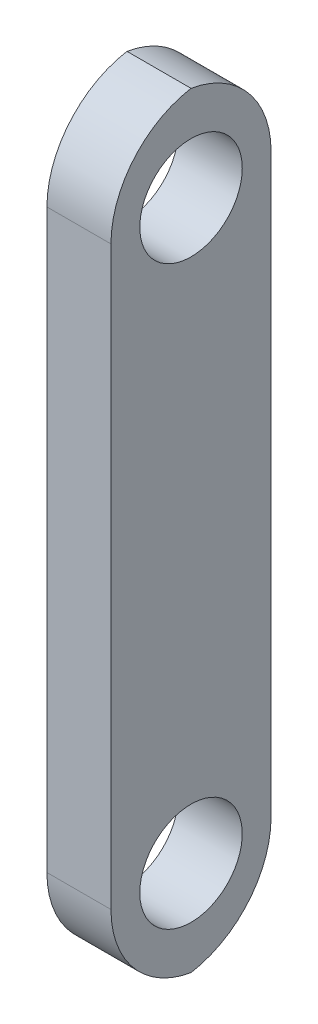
ISO-10303-21;
HEADER;
FILE_DESCRIPTION(('STEP AP214'),'2;1');
FILE_NAME('part.step','',(''),(''),'','','');
FILE_SCHEMA(('AUTOMOTIVE_DESIGN { 1 0 10303 214 1 1 1 1 }'));
ENDSEC;
DATA;
#1=APPLICATION_CONTEXT('core data for automotive mechanical design processes');
#2=APPLICATION_PROTOCOL_DEFINITION('international standard','automotive_design',2000,#1);
#3=PRODUCT_CONTEXT('',#1,'mechanical');
#4=PRODUCT('Part','Part','',(#3));
#5=PRODUCT_RELATED_PRODUCT_CATEGORY('part','',(#4));
#6=PRODUCT_DEFINITION_FORMATION('','',#4);
#7=PRODUCT_DEFINITION_CONTEXT('part definition',#1,'design');
#8=PRODUCT_DEFINITION('design','',#6,#7);
#9=PRODUCT_DEFINITION_SHAPE('','',#8);
#10=(LENGTH_UNIT() NAMED_UNIT(*) SI_UNIT(.MILLI.,.METRE.));
#11=(NAMED_UNIT(*) PLANE_ANGLE_UNIT() SI_UNIT($,.RADIAN.));
#12=(NAMED_UNIT(*) SI_UNIT($,.STERADIAN.) SOLID_ANGLE_UNIT());
#13=UNCERTAINTY_MEASURE_WITH_UNIT(LENGTH_MEASURE(1.E-05),#10,'distance_accuracy_value','');
#14=(GEOMETRIC_REPRESENTATION_CONTEXT(3) GLOBAL_UNCERTAINTY_ASSIGNED_CONTEXT((#13)) GLOBAL_UNIT_ASSIGNED_CONTEXT((#10,
#11,#12)) REPRESENTATION_CONTEXT('',''));
#15=CARTESIAN_POINT('',(0.,0.,0.));
#16=DIRECTION('',(0.,0.,1.));
#17=DIRECTION('',(1.,0.,0.));
#18=AXIS2_PLACEMENT_3D('',#15,#16,#17);
#19=CARTESIAN_POINT('',(2.,0.,-7.10219321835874));
#20=DIRECTION('',(0.,0.,1.));
#21=DIRECTION('',(0.,-1.,0.));
#22=AXIS2_PLACEMENT_3D('',#19,#20,#21);
#23=PLANE('',#22);
#24=DIRECTION('',(0.,1.,0.));
#25=VECTOR('',#24,1.);
#26=CARTESIAN_POINT('',(2.,0.,-7.10219321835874));
#27=LINE('',#26,#25);
#28=CARTESIAN_POINT('',(2.,-21.,-7.10219321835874));
#29=VERTEX_POINT('',#28);
#30=CARTESIAN_POINT('',(2.,-3.,-7.10219321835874));
#31=VERTEX_POINT('',#30);
#32=EDGE_CURVE('E120',#29,#31,#27,.T.);
#33=ORIENTED_EDGE('',*,*,#32,.F.);
#34=DIRECTION('',(-1.,0.,0.));
#35=VECTOR('',#34,1.);
#36=CARTESIAN_POINT('',(2.,-21.,-7.10219321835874));
#37=LINE('',#36,#35);
#38=CARTESIAN_POINT('',(0.,-21.,-7.10219321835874));
#39=VERTEX_POINT('',#38);
#40=EDGE_CURVE('E107',#29,#39,#37,.T.);
#41=ORIENTED_EDGE('',*,*,#40,.T.);
#42=DIRECTION('',(0.,1.,0.));
#43=VECTOR('',#42,1.);
#44=CARTESIAN_POINT('',(0.,0.,-7.10219321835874));
#45=LINE('',#44,#43);
#46=CARTESIAN_POINT('',(0.,-3.,-7.10219321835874));
#47=VERTEX_POINT('',#46);
#48=EDGE_CURVE('E118',#39,#47,#45,.T.);
#49=ORIENTED_EDGE('',*,*,#48,.T.);
#50=DIRECTION('',(-1.,0.,0.));
#51=VECTOR('',#50,1.);
#52=CARTESIAN_POINT('',(2.,-3.,-7.10219321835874));
#53=LINE('',#52,#51);
#54=EDGE_CURVE('E123',#47,#31,#53,.F.);
#55=ORIENTED_EDGE('',*,*,#54,.T.);
#56=EDGE_LOOP('',(#33,#41,#49,#55));
#57=FACE_BOUND('',#56,.T.);
#58=ADVANCED_FACE('F47',(#57),#23,.F.);
#59=CARTESIAN_POINT('',(2.,-24.,-2.10219321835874));
#60=DIRECTION('',(0.,0.,-1.));
#61=DIRECTION('',(-1.,0.,0.));
#62=AXIS2_PLACEMENT_3D('',#59,#60,#61);
#63=PLANE('',#62);
#64=DIRECTION('',(0.,-1.,0.));
#65=VECTOR('',#64,1.);
#66=CARTESIAN_POINT('',(0.,-24.,-2.10219321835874));
#67=LINE('',#66,#65);
#68=CARTESIAN_POINT('',(0.,-3.,-2.10219321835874));
#69=VERTEX_POINT('',#68);
#70=CARTESIAN_POINT('',(0.,-21.,-2.10219321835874));
#71=VERTEX_POINT('',#70);
#72=EDGE_CURVE('E128',#69,#71,#67,.T.);
#73=ORIENTED_EDGE('',*,*,#72,.T.);
#74=DIRECTION('',(-1.,0.,0.));
#75=VECTOR('',#74,1.);
#76=CARTESIAN_POINT('',(2.,-21.,-2.10219321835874));
#77=LINE('',#76,#75);
#78=CARTESIAN_POINT('',(2.,-21.,-2.10219321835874));
#79=VERTEX_POINT('',#78);
#80=EDGE_CURVE('E11',#71,#79,#77,.F.);
#81=ORIENTED_EDGE('',*,*,#80,.T.);
#82=DIRECTION('',(0.,-1.,0.));
#83=VECTOR('',#82,1.);
#84=CARTESIAN_POINT('',(2.,-24.,-2.10219321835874));
#85=LINE('',#84,#83);
#86=CARTESIAN_POINT('',(2.,-3.,-2.10219321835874));
#87=VERTEX_POINT('',#86);
#88=EDGE_CURVE('E139',#87,#79,#85,.T.);
#89=ORIENTED_EDGE('',*,*,#88,.F.);
#90=DIRECTION('',(-1.,0.,0.));
#91=VECTOR('',#90,1.);
#92=CARTESIAN_POINT('',(2.,-3.,-2.10219321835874));
#93=LINE('',#92,#91);
#94=EDGE_CURVE('E57',#87,#69,#93,.T.);
#95=ORIENTED_EDGE('',*,*,#94,.T.);
#96=EDGE_LOOP('',(#73,#81,#89,#95));
#97=FACE_BOUND('',#96,.T.);
#98=ADVANCED_FACE('F191',(#97),#63,.F.);
#99=CARTESIAN_POINT('',(2.,0.,0.));
#100=DIRECTION('',(-1.,0.,0.));
#101=DIRECTION('',(0.,0.,1.));
#102=AXIS2_PLACEMENT_3D('',#99,#100,#101);
#103=PLANE('',#102);
#104=CARTESIAN_POINT('',(2.,-3.,-4.60219321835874));
#105=DIRECTION('',(1.,0.,0.));
#106=DIRECTION('',(0.,0.,-1.));
#107=AXIS2_PLACEMENT_3D('',#104,#105,#106);
#108=CIRCLE('',#107,1.6);
#109=CARTESIAN_POINT('',(2.,-3.,-6.20219321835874));
#110=VERTEX_POINT('',#109);
#111=EDGE_CURVE('E144',#110,#110,#108,.T.);
#112=ORIENTED_EDGE('',*,*,#111,.F.);
#113=EDGE_LOOP('',(#112));
#114=FACE_BOUND('',#113,.T.);
#115=CARTESIAN_POINT('',(2.,-21.,-4.60219321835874));
#116=DIRECTION('',(1.,0.,0.));
#117=DIRECTION('',(0.,0.,1.));
#118=AXIS2_PLACEMENT_3D('',#115,#116,#117);
#119=CIRCLE('',#118,1.6);
#120=CARTESIAN_POINT('',(2.,-21.,-3.00219321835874));
#121=VERTEX_POINT('',#120);
#122=EDGE_CURVE('E168',#121,#121,#119,.T.);
#123=ORIENTED_EDGE('',*,*,#122,.F.);
#124=EDGE_LOOP('',(#123));
#125=FACE_BOUND('',#124,.T.);
#126=CARTESIAN_POINT('',(2.,-21.,-5.10219321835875));
#127=DIRECTION('',(-1.,0.,0.));
#128=DIRECTION('',(0.,0.,1.));
#129=AXIS2_PLACEMENT_3D('',#126,#127,#128);
#130=CIRCLE('',#129,3.);
#131=CARTESIAN_POINT('',(2.,-23.9580398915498,-4.60219321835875));
#132=VERTEX_POINT('',#131);
#133=EDGE_CURVE('E65',#79,#132,#130,.F.);
#134=ORIENTED_EDGE('',*,*,#133,.T.);
#135=CARTESIAN_POINT('',(2.,-21.,-4.10219321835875));
#136=DIRECTION('',(-1.,0.,0.));
#137=DIRECTION('',(0.,0.,1.));
#138=AXIS2_PLACEMENT_3D('',#135,#136,#137);
#139=CIRCLE('',#138,3.);
#140=EDGE_CURVE('E162',#132,#29,#139,.F.);
#141=ORIENTED_EDGE('',*,*,#140,.T.);
#142=ORIENTED_EDGE('',*,*,#32,.T.);
#143=CARTESIAN_POINT('',(2.,-3.,-4.10219321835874));
#144=DIRECTION('',(-1.,0.,0.));
#145=DIRECTION('',(0.,0.,1.));
#146=AXIS2_PLACEMENT_3D('',#143,#144,#145);
#147=CIRCLE('',#146,3.);
#148=CARTESIAN_POINT('',(2.,-0.0419601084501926,-4.60219321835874));
#149=VERTEX_POINT('',#148);
#150=EDGE_CURVE('E72',#31,#149,#147,.F.);
#151=ORIENTED_EDGE('',*,*,#150,.T.);
#152=CARTESIAN_POINT('',(2.,-3.,-5.10219321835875));
#153=DIRECTION('',(-1.,0.,0.));
#154=DIRECTION('',(0.,0.,1.));
#155=AXIS2_PLACEMENT_3D('',#152,#153,#154);
#156=CIRCLE('',#155,3.);
#157=EDGE_CURVE('E157',#149,#87,#156,.F.);
#158=ORIENTED_EDGE('',*,*,#157,.T.);
#159=ORIENTED_EDGE('',*,*,#88,.T.);
#160=EDGE_LOOP('',(#134,#141,#142,#151,#158,#159));
#161=FACE_BOUND('',#160,.T.);
#162=ADVANCED_FACE('F179',(#114,#125,#161),#103,.F.);
#163=CARTESIAN_POINT('',(0.,0.,0.));
#164=DIRECTION('',(-1.,0.,0.));
#165=DIRECTION('',(0.,0.,1.));
#166=AXIS2_PLACEMENT_3D('',#163,#164,#165);
#167=PLANE('',#166);
#168=CARTESIAN_POINT('',(0.,-3.,-4.60219321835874));
#169=DIRECTION('',(-1.,0.,0.));
#170=DIRECTION('',(0.,0.,1.));
#171=AXIS2_PLACEMENT_3D('',#168,#169,#170);
#172=CIRCLE('',#171,1.6);
#173=CARTESIAN_POINT('',(0.,-3.,-3.00219321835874));
#174=VERTEX_POINT('',#173);
#175=EDGE_CURVE('E129',#174,#174,#172,.T.);
#176=ORIENTED_EDGE('',*,*,#175,.F.);
#177=EDGE_LOOP('',(#176));
#178=FACE_BOUND('',#177,.T.);
#179=CARTESIAN_POINT('',(0.,-21.,-4.60219321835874));
#180=DIRECTION('',(-1.,0.,0.));
#181=DIRECTION('',(0.,0.,1.));
#182=AXIS2_PLACEMENT_3D('',#179,#180,#181);
#183=CIRCLE('',#182,1.6);
#184=CARTESIAN_POINT('',(0.,-21.,-3.00219321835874));
#185=VERTEX_POINT('',#184);
#186=EDGE_CURVE('E136',#185,#185,#183,.T.);
#187=ORIENTED_EDGE('',*,*,#186,.F.);
#188=EDGE_LOOP('',(#187));
#189=FACE_BOUND('',#188,.T.);
#190=ORIENTED_EDGE('',*,*,#48,.F.);
#191=CARTESIAN_POINT('',(0.,-21.,-4.10219321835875));
#192=DIRECTION('',(-1.,0.,0.));
#193=DIRECTION('',(0.,0.,1.));
#194=AXIS2_PLACEMENT_3D('',#191,#192,#193);
#195=CIRCLE('',#194,3.);
#196=CARTESIAN_POINT('',(0.,-23.9580398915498,-4.60219321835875));
#197=VERTEX_POINT('',#196);
#198=EDGE_CURVE('E103',#39,#197,#195,.T.);
#199=ORIENTED_EDGE('',*,*,#198,.T.);
#200=CARTESIAN_POINT('',(0.,-21.,-5.10219321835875));
#201=DIRECTION('',(-1.,0.,0.));
#202=DIRECTION('',(0.,0.,1.));
#203=AXIS2_PLACEMENT_3D('',#200,#201,#202);
#204=CIRCLE('',#203,3.);
#205=EDGE_CURVE('E113',#197,#71,#204,.T.);
#206=ORIENTED_EDGE('',*,*,#205,.T.);
#207=ORIENTED_EDGE('',*,*,#72,.F.);
#208=CARTESIAN_POINT('',(0.,-3.,-5.10219321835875));
#209=DIRECTION('',(-1.,0.,0.));
#210=DIRECTION('',(0.,0.,1.));
#211=AXIS2_PLACEMENT_3D('',#208,#209,#210);
#212=CIRCLE('',#211,3.);
#213=CARTESIAN_POINT('',(0.,-0.0419601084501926,-4.60219321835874));
#214=VERTEX_POINT('',#213);
#215=EDGE_CURVE('E150',#69,#214,#212,.T.);
#216=ORIENTED_EDGE('',*,*,#215,.T.);
#217=CARTESIAN_POINT('',(0.,-3.,-4.10219321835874));
#218=DIRECTION('',(-1.,0.,0.));
#219=DIRECTION('',(0.,0.,1.));
#220=AXIS2_PLACEMENT_3D('',#217,#218,#219);
#221=CIRCLE('',#220,3.);
#222=EDGE_CURVE('E122',#214,#47,#221,.T.);
#223=ORIENTED_EDGE('',*,*,#222,.T.);
#224=EDGE_LOOP('',(#190,#199,#206,#207,#216,#223));
#225=FACE_BOUND('',#224,.T.);
#226=ADVANCED_FACE('F125',(#178,#189,#225),#167,.T.);
#227=CARTESIAN_POINT('',(-2.,-21.,-4.60219321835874));
#228=DIRECTION('',(1.,0.,0.));
#229=DIRECTION('',(0.,0.,-1.));
#230=AXIS2_PLACEMENT_3D('',#227,#228,#229);
#231=CYLINDRICAL_SURFACE('',#230,1.6);
#232=ORIENTED_EDGE('',*,*,#186,.T.);
#233=EDGE_LOOP('',(#232));
#234=FACE_BOUND('',#233,.T.);
#235=ORIENTED_EDGE('',*,*,#122,.T.);
#236=EDGE_LOOP('',(#235));
#237=FACE_BOUND('',#236,.T.);
#238=ADVANCED_FACE('F195',(#234,#237),#231,.F.);
#239=CARTESIAN_POINT('',(-2.,-3.,-4.60219321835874));
#240=DIRECTION('',(1.,0.,0.));
#241=DIRECTION('',(0.,0.,-1.));
#242=AXIS2_PLACEMENT_3D('',#239,#240,#241);
#243=CYLINDRICAL_SURFACE('',#242,1.6);
#244=ORIENTED_EDGE('',*,*,#175,.T.);
#245=EDGE_LOOP('',(#244));
#246=FACE_BOUND('',#245,.T.);
#247=ORIENTED_EDGE('',*,*,#111,.T.);
#248=EDGE_LOOP('',(#247));
#249=FACE_BOUND('',#248,.T.);
#250=ADVANCED_FACE('F187',(#246,#249),#243,.F.);
#251=CARTESIAN_POINT('',(2.,-21.,-5.10219321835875));
#252=DIRECTION('',(-1.,0.,0.));
#253=DIRECTION('',(0.,0.,1.));
#254=AXIS2_PLACEMENT_3D('',#251,#252,#253);
#255=CYLINDRICAL_SURFACE('',#254,3.);
#256=DIRECTION('',(-1.,0.,0.));
#257=VECTOR('',#256,1.);
#258=CARTESIAN_POINT('',(1.,-23.9580398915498,-4.60219321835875));
#259=LINE('',#258,#257);
#260=EDGE_CURVE('E108',#132,#197,#259,.T.);
#261=ORIENTED_EDGE('',*,*,#260,.F.);
#262=ORIENTED_EDGE('',*,*,#133,.F.);
#263=ORIENTED_EDGE('',*,*,#80,.F.);
#264=ORIENTED_EDGE('',*,*,#205,.F.);
#265=EDGE_LOOP('',(#261,#262,#263,#264));
#266=FACE_BOUND('',#265,.T.);
#267=ADVANCED_FACE('F202',(#266),#255,.T.);
#268=CARTESIAN_POINT('',(2.,-21.,-4.10219321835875));
#269=DIRECTION('',(-1.,0.,0.));
#270=DIRECTION('',(0.,0.,1.));
#271=AXIS2_PLACEMENT_3D('',#268,#269,#270);
#272=CYLINDRICAL_SURFACE('',#271,3.);
#273=ORIENTED_EDGE('',*,*,#140,.F.);
#274=ORIENTED_EDGE('',*,*,#260,.T.);
#275=ORIENTED_EDGE('',*,*,#198,.F.);
#276=ORIENTED_EDGE('',*,*,#40,.F.);
#277=EDGE_LOOP('',(#273,#274,#275,#276));
#278=FACE_BOUND('',#277,.T.);
#279=ADVANCED_FACE('F106',(#278),#272,.T.);
#280=CARTESIAN_POINT('',(2.,-3.,-4.10219321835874));
#281=DIRECTION('',(-1.,0.,0.));
#282=DIRECTION('',(0.,0.,1.));
#283=AXIS2_PLACEMENT_3D('',#280,#281,#282);
#284=CYLINDRICAL_SURFACE('',#283,3.);
#285=DIRECTION('',(-1.,0.,0.));
#286=VECTOR('',#285,1.);
#287=CARTESIAN_POINT('',(1.,-0.0419601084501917,-4.60219321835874));
#288=LINE('',#287,#286);
#289=EDGE_CURVE('E51',#149,#214,#288,.T.);
#290=ORIENTED_EDGE('',*,*,#289,.F.);
#291=ORIENTED_EDGE('',*,*,#150,.F.);
#292=ORIENTED_EDGE('',*,*,#54,.F.);
#293=ORIENTED_EDGE('',*,*,#222,.F.);
#294=EDGE_LOOP('',(#290,#291,#292,#293));
#295=FACE_BOUND('',#294,.T.);
#296=ADVANCED_FACE('F49',(#295),#284,.T.);
#297=CARTESIAN_POINT('',(2.,-3.,-5.10219321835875));
#298=DIRECTION('',(-1.,0.,0.));
#299=DIRECTION('',(0.,0.,1.));
#300=AXIS2_PLACEMENT_3D('',#297,#298,#299);
#301=CYLINDRICAL_SURFACE('',#300,3.);
#302=ORIENTED_EDGE('',*,*,#157,.F.);
#303=ORIENTED_EDGE('',*,*,#289,.T.);
#304=ORIENTED_EDGE('',*,*,#215,.F.);
#305=ORIENTED_EDGE('',*,*,#94,.F.);
#306=EDGE_LOOP('',(#302,#303,#304,#305));
#307=FACE_BOUND('',#306,.T.);
#308=ADVANCED_FACE('F176',(#307),#301,.T.);
#309=CLOSED_SHELL('',(#58,#98,#162,#226,#238,#250,#267,#279,#296,#308));
#310=MANIFOLD_SOLID_BREP('B2',#309);
#311=ADVANCED_BREP_SHAPE_REPRESENTATION('',(#18,#310),#14);
#312=SHAPE_DEFINITION_REPRESENTATION(#9,#311);
ENDSEC;
END-ISO-10303-21;
